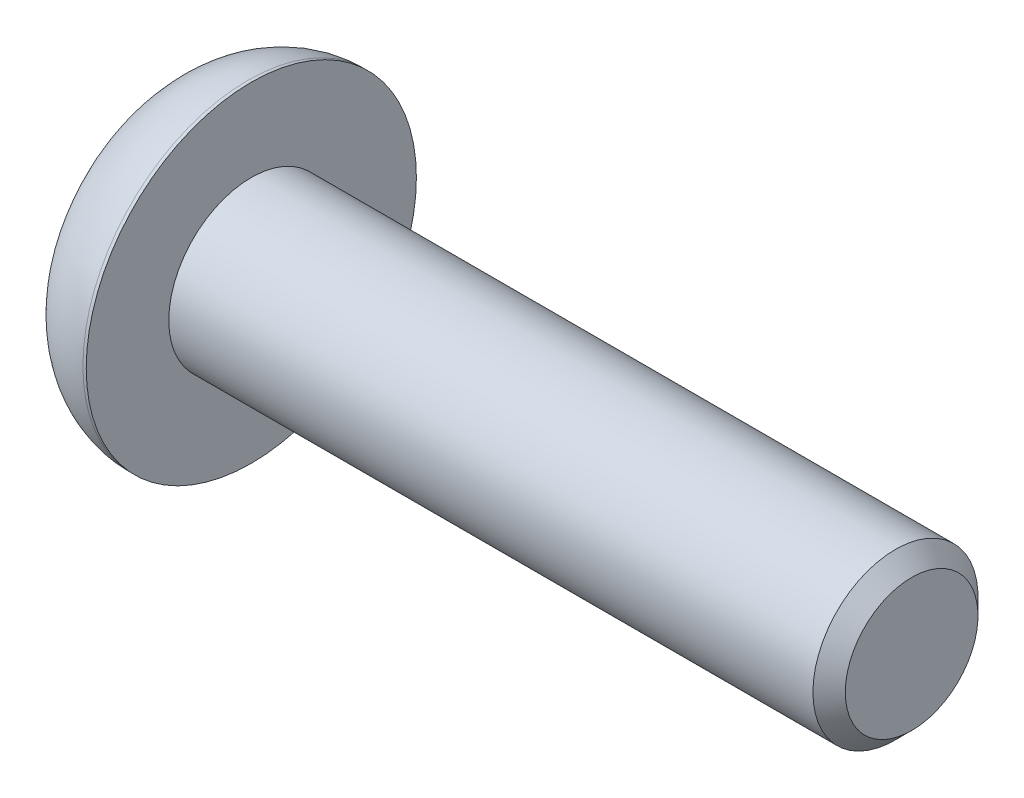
ISO-10303-21;
HEADER;
FILE_DESCRIPTION(('STEP AP214'),'2;1');
FILE_NAME('part.step','',(''),(''),'','','');
FILE_SCHEMA(('AUTOMOTIVE_DESIGN { 1 0 10303 214 1 1 1 1 }'));
ENDSEC;
DATA;
#1=APPLICATION_CONTEXT('core data for automotive mechanical design processes');
#2=APPLICATION_PROTOCOL_DEFINITION('international standard','automotive_design',2000,#1);
#3=PRODUCT_CONTEXT('',#1,'mechanical');
#4=PRODUCT('Part','Part','',(#3));
#5=PRODUCT_RELATED_PRODUCT_CATEGORY('part','',(#4));
#6=PRODUCT_DEFINITION_FORMATION('','',#4);
#7=PRODUCT_DEFINITION_CONTEXT('part definition',#1,'design');
#8=PRODUCT_DEFINITION('design','',#6,#7);
#9=PRODUCT_DEFINITION_SHAPE('','',#8);
#10=(LENGTH_UNIT() NAMED_UNIT(*) SI_UNIT(.MILLI.,.METRE.));
#11=(NAMED_UNIT(*) PLANE_ANGLE_UNIT() SI_UNIT($,.RADIAN.));
#12=(NAMED_UNIT(*) SI_UNIT($,.STERADIAN.) SOLID_ANGLE_UNIT());
#13=UNCERTAINTY_MEASURE_WITH_UNIT(LENGTH_MEASURE(1.E-05),#10,'distance_accuracy_value','');
#14=(GEOMETRIC_REPRESENTATION_CONTEXT(3) GLOBAL_UNCERTAINTY_ASSIGNED_CONTEXT((#13)) GLOBAL_UNIT_ASSIGNED_CONTEXT((#10,
#11,#12)) REPRESENTATION_CONTEXT('',''));
#15=CARTESIAN_POINT('',(0.,0.,0.));
#16=DIRECTION('',(0.,0.,1.));
#17=DIRECTION('',(1.,0.,0.));
#18=AXIS2_PLACEMENT_3D('',#15,#16,#17);
#19=CARTESIAN_POINT('',(1.93397459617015,0.,0.));
#20=DIRECTION('',(-1.,0.,0.));
#21=DIRECTION('',(0.,0.,1.));
#22=AXIS2_PLACEMENT_3D('',#19,#20,#21);
#23=CONICAL_SURFACE('',#22,1.50000000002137,1.04719755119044);
#24=CARTESIAN_POINT('',(2.79999999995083,2.84147705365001E-11,0.));
#25=VERTEX_POINT('',#24);
#26=VERTEX_LOOP('',#25);
#27=FACE_BOUND('',#26,.T.);
#28=CARTESIAN_POINT('',(1.93397459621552,0.,0.));
#29=DIRECTION('',(-1.,0.,0.));
#30=DIRECTION('',(0.,0.,1.));
#31=AXIS2_PLACEMENT_3D('',#28,#29,#30);
#32=CIRCLE('',#31,1.5);
#33=CARTESIAN_POINT('',(1.93397459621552,0.,1.5));
#34=VERTEX_POINT('',#33);
#35=EDGE_CURVE('E133',#34,#34,#32,.T.);
#36=ORIENTED_EDGE('',*,*,#35,.T.);
#37=EDGE_LOOP('',(#36));
#38=FACE_BOUND('',#37,.T.);
#39=ADVANCED_FACE('F16',(#27,#38),#23,.F.);
#40=CARTESIAN_POINT('',(0.966987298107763,0.,0.));
#41=DIRECTION('',(-1.,0.,0.));
#42=DIRECTION('',(0.,0.,1.));
#43=AXIS2_PLACEMENT_3D('',#40,#41,#42);
#44=CYLINDRICAL_SURFACE('',#43,1.5);
#45=ORIENTED_EDGE('',*,*,#35,.F.);
#46=EDGE_LOOP('',(#45));
#47=FACE_BOUND('',#46,.T.);
#48=CARTESIAN_POINT('',(1.82,0.,0.));
#49=DIRECTION('',(-1.,0.,0.));
#50=DIRECTION('',(0.,0.,1.));
#51=AXIS2_PLACEMENT_3D('',#48,#49,#50);
#52=CIRCLE('',#51,1.5);
#53=CARTESIAN_POINT('',(1.82000000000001,1.29903810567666,-0.750000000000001));
#54=VERTEX_POINT('',#53);
#55=CARTESIAN_POINT('',(1.82000000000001,1.29903810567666,0.750000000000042));
#56=VERTEX_POINT('',#55);
#57=EDGE_CURVE('E104',#54,#56,#52,.F.);
#58=ORIENTED_EDGE('',*,*,#57,.F.);
#59=CARTESIAN_POINT('',(1.82,0.,0.));
#60=DIRECTION('',(-1.,0.,0.));
#61=DIRECTION('',(0.,0.,1.));
#62=AXIS2_PLACEMENT_3D('',#59,#60,#61);
#63=CIRCLE('',#62,1.5);
#64=CARTESIAN_POINT('',(1.82000000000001,0.,-1.49999999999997));
#65=VERTEX_POINT('',#64);
#66=EDGE_CURVE('E112',#65,#54,#63,.F.);
#67=ORIENTED_EDGE('',*,*,#66,.F.);
#68=CARTESIAN_POINT('',(1.82,0.,0.));
#69=DIRECTION('',(-1.,0.,0.));
#70=DIRECTION('',(0.,0.,1.));
#71=AXIS2_PLACEMENT_3D('',#68,#69,#70);
#72=CIRCLE('',#71,1.5);
#73=CARTESIAN_POINT('',(1.81999999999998,-1.29903810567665,-0.750000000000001));
#74=VERTEX_POINT('',#73);
#75=EDGE_CURVE('E274',#65,#74,#72,.T.);
#76=ORIENTED_EDGE('',*,*,#75,.T.);
#77=CARTESIAN_POINT('',(1.82,0.,0.));
#78=DIRECTION('',(-1.,0.,0.));
#79=DIRECTION('',(0.,0.,1.));
#80=AXIS2_PLACEMENT_3D('',#77,#78,#79);
#81=CIRCLE('',#80,1.5);
#82=CARTESIAN_POINT('',(1.82000000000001,-1.29903810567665,0.750000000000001));
#83=VERTEX_POINT('',#82);
#84=EDGE_CURVE('E111',#74,#83,#81,.T.);
#85=ORIENTED_EDGE('',*,*,#84,.T.);
#86=CARTESIAN_POINT('',(1.82,0.,0.));
#87=DIRECTION('',(-1.,0.,0.));
#88=DIRECTION('',(0.,0.,1.));
#89=AXIS2_PLACEMENT_3D('',#86,#87,#88);
#90=CIRCLE('',#89,1.5);
#91=CARTESIAN_POINT('',(1.81999999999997,0.,1.50000000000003));
#92=VERTEX_POINT('',#91);
#93=EDGE_CURVE('E131',#92,#83,#90,.F.);
#94=ORIENTED_EDGE('',*,*,#93,.F.);
#95=CARTESIAN_POINT('',(1.82,0.,0.));
#96=DIRECTION('',(-1.,0.,0.));
#97=DIRECTION('',(0.,0.,1.));
#98=AXIS2_PLACEMENT_3D('',#95,#96,#97);
#99=CIRCLE('',#98,1.5);
#100=EDGE_CURVE('E98',#56,#92,#99,.F.);
#101=ORIENTED_EDGE('',*,*,#100,.F.);
#102=EDGE_LOOP('',(#58,#67,#76,#85,#94,#101));
#103=FACE_BOUND('',#102,.T.);
#104=ADVANCED_FACE('F129',(#47,#103),#44,.F.);
#105=CARTESIAN_POINT('',(1.82,0.,0.));
#106=DIRECTION('',(1.,0.,0.));
#107=DIRECTION('',(0.,0.,-1.));
#108=AXIS2_PLACEMENT_3D('',#105,#106,#107);
#109=PLANE('',#108);
#110=DIRECTION('',(0.,0.499999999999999,-0.866025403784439));
#111=VECTOR('',#110,1.);
#112=CARTESIAN_POINT('',(1.81999999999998,-0.866025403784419,-1.49999999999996));
#113=LINE('',#112,#111);
#114=CARTESIAN_POINT('',(1.81999999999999,-1.73205080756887,0.));
#115=VERTEX_POINT('',#114);
#116=EDGE_CURVE('E273',#74,#115,#113,.F.);
#117=ORIENTED_EDGE('',*,*,#116,.T.);
#118=DIRECTION('',(0.,-0.5,-0.866025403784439));
#119=VECTOR('',#118,1.);
#120=CARTESIAN_POINT('',(1.81999999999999,-1.73205080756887,0.));
#121=LINE('',#120,#119);
#122=EDGE_CURVE('E263',#115,#83,#121,.F.);
#123=ORIENTED_EDGE('',*,*,#122,.T.);
#124=ORIENTED_EDGE('',*,*,#84,.F.);
#125=EDGE_LOOP('',(#117,#123,#124));
#126=FACE_BOUND('',#125,.T.);
#127=ADVANCED_FACE('F333',(#126),#109,.F.);
#128=CARTESIAN_POINT('',(1.82,0.,0.));
#129=DIRECTION('',(1.,0.,0.));
#130=DIRECTION('',(0.,0.,-1.));
#131=AXIS2_PLACEMENT_3D('',#128,#129,#130);
#132=PLANE('',#131);
#133=DIRECTION('',(0.,1.,0.));
#134=VECTOR('',#133,1.);
#135=CARTESIAN_POINT('',(1.81999999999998,0.866025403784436,-1.5));
#136=LINE('',#135,#134);
#137=CARTESIAN_POINT('',(1.81999999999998,-0.866025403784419,-1.49999999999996));
#138=VERTEX_POINT('',#137);
#139=EDGE_CURVE('E239',#65,#138,#136,.F.);
#140=ORIENTED_EDGE('',*,*,#139,.T.);
#141=DIRECTION('',(0.,0.499999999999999,-0.866025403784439));
#142=VECTOR('',#141,1.);
#143=CARTESIAN_POINT('',(1.81999999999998,-0.866025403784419,-1.49999999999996));
#144=LINE('',#143,#142);
#145=EDGE_CURVE('E270',#138,#74,#144,.F.);
#146=ORIENTED_EDGE('',*,*,#145,.T.);
#147=ORIENTED_EDGE('',*,*,#75,.F.);
#148=EDGE_LOOP('',(#140,#146,#147));
#149=FACE_BOUND('',#148,.T.);
#150=ADVANCED_FACE('F325',(#149),#132,.F.);
#151=CARTESIAN_POINT('',(0.,-0.866025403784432,-1.49999999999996));
#152=DIRECTION('',(0.,-0.866025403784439,-0.500000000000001));
#153=DIRECTION('',(0.,0.499999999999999,-0.866025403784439));
#154=AXIS2_PLACEMENT_3D('',#151,#152,#153);
#155=PLANE('',#154);
#156=DIRECTION('',(1.,0.,0.));
#157=VECTOR('',#156,1.);
#158=CARTESIAN_POINT('',(0.,-1.73205080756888,0.));
#159=LINE('',#158,#157);
#160=CARTESIAN_POINT('',(0.,-1.73205080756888,0.));
#161=VERTEX_POINT('',#160);
#162=EDGE_CURVE('E283',#161,#115,#159,.T.);
#163=ORIENTED_EDGE('',*,*,#162,.T.);
#164=ORIENTED_EDGE('',*,*,#116,.F.);
#165=ORIENTED_EDGE('',*,*,#145,.F.);
#166=DIRECTION('',(-1.,0.,0.));
#167=VECTOR('',#166,1.);
#168=CARTESIAN_POINT('',(0.,-0.866025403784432,-1.49999999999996));
#169=LINE('',#168,#167);
#170=CARTESIAN_POINT('',(0.,-0.866025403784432,-1.49999999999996));
#171=VERTEX_POINT('',#170);
#172=EDGE_CURVE('E267',#138,#171,#169,.T.);
#173=ORIENTED_EDGE('',*,*,#172,.T.);
#174=DIRECTION('',(0.,0.499999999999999,-0.866025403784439));
#175=VECTOR('',#174,1.);
#176=CARTESIAN_POINT('',(0.,-0.866025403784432,-1.49999999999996));
#177=LINE('',#176,#175);
#178=EDGE_CURVE('E288',#161,#171,#177,.T.);
#179=ORIENTED_EDGE('',*,*,#178,.F.);
#180=EDGE_LOOP('',(#163,#164,#165,#173,#179));
#181=FACE_BOUND('',#180,.T.);
#182=ADVANCED_FACE('F329',(#181),#155,.F.);
#183=CARTESIAN_POINT('',(0.,-1.73205080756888,0.));
#184=DIRECTION('',(0.,-0.866025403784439,0.5));
#185=DIRECTION('',(0.,-0.5,-0.866025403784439));
#186=AXIS2_PLACEMENT_3D('',#183,#184,#185);
#187=PLANE('',#186);
#188=DIRECTION('',(1.,0.,0.));
#189=VECTOR('',#188,1.);
#190=CARTESIAN_POINT('',(0.,-0.866025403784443,1.5));
#191=LINE('',#190,#189);
#192=CARTESIAN_POINT('',(0.,-0.866025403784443,1.5));
#193=VERTEX_POINT('',#192);
#194=CARTESIAN_POINT('',(1.82,-0.866025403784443,1.50000000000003));
#195=VERTEX_POINT('',#194);
#196=EDGE_CURVE('E249',#193,#195,#191,.T.);
#197=ORIENTED_EDGE('',*,*,#196,.T.);
#198=DIRECTION('',(0.,-0.5,-0.866025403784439));
#199=VECTOR('',#198,1.);
#200=CARTESIAN_POINT('',(1.82000000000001,-0.866025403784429,1.50000000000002));
#201=LINE('',#200,#199);
#202=EDGE_CURVE('E240',#195,#83,#201,.T.);
#203=ORIENTED_EDGE('',*,*,#202,.T.);
#204=ORIENTED_EDGE('',*,*,#122,.F.);
#205=ORIENTED_EDGE('',*,*,#162,.F.);
#206=DIRECTION('',(0.,-0.5,-0.866025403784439));
#207=VECTOR('',#206,1.);
#208=CARTESIAN_POINT('',(0.,-1.73205080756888,0.));
#209=LINE('',#208,#207);
#210=EDGE_CURVE('E258',#193,#161,#209,.T.);
#211=ORIENTED_EDGE('',*,*,#210,.F.);
#212=EDGE_LOOP('',(#197,#203,#204,#205,#211));
#213=FACE_BOUND('',#212,.T.);
#214=ADVANCED_FACE('F339',(#213),#187,.F.);
#215=CARTESIAN_POINT('',(1.82,0.,0.));
#216=DIRECTION('',(1.,0.,0.));
#217=DIRECTION('',(0.,0.,-1.));
#218=AXIS2_PLACEMENT_3D('',#215,#216,#217);
#219=PLANE('',#218);
#220=ORIENTED_EDGE('',*,*,#202,.F.);
#221=DIRECTION('',(0.,1.,0.));
#222=VECTOR('',#221,1.);
#223=CARTESIAN_POINT('',(1.82000000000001,-0.866025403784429,1.50000000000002));
#224=LINE('',#223,#222);
#225=EDGE_CURVE('E226',#195,#92,#224,.T.);
#226=ORIENTED_EDGE('',*,*,#225,.T.);
#227=ORIENTED_EDGE('',*,*,#93,.T.);
#228=EDGE_LOOP('',(#220,#226,#227));
#229=FACE_BOUND('',#228,.T.);
#230=ADVANCED_FACE('F336',(#229),#219,.F.);
#231=CARTESIAN_POINT('',(1.82,0.,0.));
#232=DIRECTION('',(1.,0.,0.));
#233=DIRECTION('',(0.,0.,-1.));
#234=AXIS2_PLACEMENT_3D('',#231,#232,#233);
#235=PLANE('',#234);
#236=DIRECTION('',(0.,0.5,0.866025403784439));
#237=VECTOR('',#236,1.);
#238=CARTESIAN_POINT('',(1.82000000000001,1.73205080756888,0.));
#239=LINE('',#238,#237);
#240=CARTESIAN_POINT('',(1.81999999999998,0.866025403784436,-1.5));
#241=VERTEX_POINT('',#240);
#242=EDGE_CURVE('E210',#54,#241,#239,.F.);
#243=ORIENTED_EDGE('',*,*,#242,.T.);
#244=DIRECTION('',(0.,1.,0.));
#245=VECTOR('',#244,1.);
#246=CARTESIAN_POINT('',(1.81999999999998,0.866025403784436,-1.5));
#247=LINE('',#246,#245);
#248=EDGE_CURVE('E236',#241,#65,#247,.F.);
#249=ORIENTED_EDGE('',*,*,#248,.T.);
#250=ORIENTED_EDGE('',*,*,#66,.T.);
#251=EDGE_LOOP('',(#243,#249,#250));
#252=FACE_BOUND('',#251,.T.);
#253=ADVANCED_FACE('F311',(#252),#235,.F.);
#254=CARTESIAN_POINT('',(0.,0.866025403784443,-1.49999999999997));
#255=DIRECTION('',(0.,0.,-1.));
#256=DIRECTION('',(-1.,0.,0.));
#257=AXIS2_PLACEMENT_3D('',#254,#255,#256);
#258=PLANE('',#257);
#259=ORIENTED_EDGE('',*,*,#172,.F.);
#260=ORIENTED_EDGE('',*,*,#139,.F.);
#261=ORIENTED_EDGE('',*,*,#248,.F.);
#262=DIRECTION('',(1.,0.,0.));
#263=VECTOR('',#262,1.);
#264=CARTESIAN_POINT('',(0.,0.866025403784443,-1.49999999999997));
#265=LINE('',#264,#263);
#266=CARTESIAN_POINT('',(0.,0.866025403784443,-1.49999999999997));
#267=VERTEX_POINT('',#266);
#268=EDGE_CURVE('E203',#241,#267,#265,.F.);
#269=ORIENTED_EDGE('',*,*,#268,.T.);
#270=DIRECTION('',(0.,1.,0.));
#271=VECTOR('',#270,1.);
#272=CARTESIAN_POINT('',(0.,0.866025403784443,-1.49999999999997));
#273=LINE('',#272,#271);
#274=EDGE_CURVE('E253',#171,#267,#273,.T.);
#275=ORIENTED_EDGE('',*,*,#274,.F.);
#276=EDGE_LOOP('',(#259,#260,#261,#269,#275));
#277=FACE_BOUND('',#276,.T.);
#278=ADVANCED_FACE('F321',(#277),#258,.F.);
#279=CARTESIAN_POINT('',(0.,-0.866025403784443,1.5));
#280=DIRECTION('',(0.,0.,1.));
#281=DIRECTION('',(1.,0.,0.));
#282=AXIS2_PLACEMENT_3D('',#279,#280,#281);
#283=PLANE('',#282);
#284=DIRECTION('',(1.,0.,0.));
#285=VECTOR('',#284,1.);
#286=CARTESIAN_POINT('',(0.,0.86602540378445,1.5));
#287=LINE('',#286,#285);
#288=CARTESIAN_POINT('',(0.,0.86602540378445,1.5));
#289=VERTEX_POINT('',#288);
#290=CARTESIAN_POINT('',(1.81999999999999,0.866025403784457,1.5));
#291=VERTEX_POINT('',#290);
#292=EDGE_CURVE('E126',#289,#291,#287,.T.);
#293=ORIENTED_EDGE('',*,*,#292,.T.);
#294=DIRECTION('',(0.,1.,0.));
#295=VECTOR('',#294,1.);
#296=CARTESIAN_POINT('',(1.81999999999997,0.,1.50000000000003));
#297=LINE('',#296,#295);
#298=EDGE_CURVE('E125',#291,#92,#297,.F.);
#299=ORIENTED_EDGE('',*,*,#298,.T.);
#300=ORIENTED_EDGE('',*,*,#225,.F.);
#301=ORIENTED_EDGE('',*,*,#196,.F.);
#302=DIRECTION('',(0.,1.,0.));
#303=VECTOR('',#302,1.);
#304=CARTESIAN_POINT('',(0.,-0.866025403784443,1.5));
#305=LINE('',#304,#303);
#306=EDGE_CURVE('E218',#289,#193,#305,.F.);
#307=ORIENTED_EDGE('',*,*,#306,.F.);
#308=EDGE_LOOP('',(#293,#299,#300,#301,#307));
#309=FACE_BOUND('',#308,.T.);
#310=ADVANCED_FACE('F342',(#309),#283,.F.);
#311=CARTESIAN_POINT('',(1.82,0.,0.));
#312=DIRECTION('',(1.,0.,0.));
#313=DIRECTION('',(0.,0.,-1.));
#314=AXIS2_PLACEMENT_3D('',#311,#312,#313);
#315=PLANE('',#314);
#316=ORIENTED_EDGE('',*,*,#298,.F.);
#317=DIRECTION('',(0.,-0.499999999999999,0.866025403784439));
#318=VECTOR('',#317,1.);
#319=CARTESIAN_POINT('',(1.81999999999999,0.866025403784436,1.5));
#320=LINE('',#319,#318);
#321=EDGE_CURVE('E119',#291,#56,#320,.F.);
#322=ORIENTED_EDGE('',*,*,#321,.T.);
#323=ORIENTED_EDGE('',*,*,#100,.T.);
#324=EDGE_LOOP('',(#316,#322,#323));
#325=FACE_BOUND('',#324,.T.);
#326=ADVANCED_FACE('F124',(#325),#315,.F.);
#327=CARTESIAN_POINT('',(1.82,0.,0.));
#328=DIRECTION('',(1.,0.,0.));
#329=DIRECTION('',(0.,0.,-1.));
#330=AXIS2_PLACEMENT_3D('',#327,#328,#329);
#331=PLANE('',#330);
#332=DIRECTION('',(0.,-0.499999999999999,0.866025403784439));
#333=VECTOR('',#332,1.);
#334=CARTESIAN_POINT('',(1.81999999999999,0.866025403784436,1.5));
#335=LINE('',#334,#333);
#336=CARTESIAN_POINT('',(1.82000000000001,1.73205080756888,0.));
#337=VERTEX_POINT('',#336);
#338=EDGE_CURVE('E107',#56,#337,#335,.F.);
#339=ORIENTED_EDGE('',*,*,#338,.T.);
#340=DIRECTION('',(0.,0.5,0.866025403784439));
#341=VECTOR('',#340,1.);
#342=CARTESIAN_POINT('',(1.82000000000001,1.73205080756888,0.));
#343=LINE('',#342,#341);
#344=EDGE_CURVE('E109',#337,#54,#343,.F.);
#345=ORIENTED_EDGE('',*,*,#344,.T.);
#346=ORIENTED_EDGE('',*,*,#57,.T.);
#347=EDGE_LOOP('',(#339,#345,#346));
#348=FACE_BOUND('',#347,.T.);
#349=ADVANCED_FACE('F106',(#348),#331,.F.);
#350=CARTESIAN_POINT('',(0.,1.73205080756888,0.));
#351=DIRECTION('',(0.,0.866025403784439,-0.5));
#352=DIRECTION('',(0.,0.5,0.866025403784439));
#353=AXIS2_PLACEMENT_3D('',#350,#351,#352);
#354=PLANE('',#353);
#355=ORIENTED_EDGE('',*,*,#268,.F.);
#356=ORIENTED_EDGE('',*,*,#242,.F.);
#357=ORIENTED_EDGE('',*,*,#344,.F.);
#358=DIRECTION('',(1.,0.,0.));
#359=VECTOR('',#358,1.);
#360=CARTESIAN_POINT('',(0.,1.73205080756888,0.));
#361=LINE('',#360,#359);
#362=CARTESIAN_POINT('',(0.,1.73205080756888,0.));
#363=VERTEX_POINT('',#362);
#364=EDGE_CURVE('E122',#337,#363,#361,.F.);
#365=ORIENTED_EDGE('',*,*,#364,.T.);
#366=DIRECTION('',(0.,0.5,0.866025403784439));
#367=VECTOR('',#366,1.);
#368=CARTESIAN_POINT('',(0.,1.73205080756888,0.));
#369=LINE('',#368,#367);
#370=EDGE_CURVE('E196',#267,#363,#369,.T.);
#371=ORIENTED_EDGE('',*,*,#370,.F.);
#372=EDGE_LOOP('',(#355,#356,#357,#365,#371));
#373=FACE_BOUND('',#372,.T.);
#374=ADVANCED_FACE('F316',(#373),#354,.F.);
#375=CARTESIAN_POINT('',(0.,0.86602540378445,1.5));
#376=DIRECTION('',(0.,0.866025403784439,0.500000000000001));
#377=DIRECTION('',(0.,-0.499999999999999,0.866025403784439));
#378=AXIS2_PLACEMENT_3D('',#375,#376,#377);
#379=PLANE('',#378);
#380=ORIENTED_EDGE('',*,*,#364,.F.);
#381=ORIENTED_EDGE('',*,*,#338,.F.);
#382=ORIENTED_EDGE('',*,*,#321,.F.);
#383=ORIENTED_EDGE('',*,*,#292,.F.);
#384=DIRECTION('',(0.,-0.499999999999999,0.866025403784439));
#385=VECTOR('',#384,1.);
#386=CARTESIAN_POINT('',(0.,1.73205080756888,0.));
#387=LINE('',#386,#385);
#388=EDGE_CURVE('E214',#363,#289,#387,.T.);
#389=ORIENTED_EDGE('',*,*,#388,.F.);
#390=EDGE_LOOP('',(#380,#381,#382,#383,#389));
#391=FACE_BOUND('',#390,.T.);
#392=ADVANCED_FACE('F117',(#391),#379,.F.);
#393=CARTESIAN_POINT('',(0.,1.15000000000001,0.));
#394=DIRECTION('',(-1.,0.,0.));
#395=DIRECTION('',(0.,0.,1.));
#396=AXIS2_PLACEMENT_3D('',#393,#394,#395);
#397=PLANE('',#396);
#398=CARTESIAN_POINT('',(0.,0.,0.));
#399=DIRECTION('',(1.,0.,0.));
#400=DIRECTION('',(0.,0.,1.));
#401=AXIS2_PLACEMENT_3D('',#398,#399,#400);
#402=CIRCLE('',#401,2.30000000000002);
#403=CARTESIAN_POINT('',(0.,0.,2.30000000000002));
#404=VERTEX_POINT('',#403);
#405=CARTESIAN_POINT('',(0.,0.,-2.29999999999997));
#406=VERTEX_POINT('',#405);
#407=EDGE_CURVE('E174',#404,#406,#402,.T.);
#408=ORIENTED_EDGE('',*,*,#407,.F.);
#409=CARTESIAN_POINT('',(0.,0.,0.));
#410=DIRECTION('',(1.,0.,0.));
#411=DIRECTION('',(0.,1.,0.));
#412=AXIS2_PLACEMENT_3D('',#409,#410,#411);
#413=CIRCLE('',#412,2.30000000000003);
#414=CARTESIAN_POINT('',(0.,2.3,0.));
#415=VERTEX_POINT('',#414);
#416=EDGE_CURVE('E184',#415,#404,#413,.T.);
#417=ORIENTED_EDGE('',*,*,#416,.F.);
#418=CARTESIAN_POINT('',(0.,0.,0.));
#419=DIRECTION('',(1.,0.,0.));
#420=DIRECTION('',(0.,0.,-1.));
#421=AXIS2_PLACEMENT_3D('',#418,#419,#420);
#422=CIRCLE('',#421,2.30000000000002);
#423=EDGE_CURVE('E36',#406,#415,#422,.T.);
#424=ORIENTED_EDGE('',*,*,#423,.F.);
#425=EDGE_LOOP('',(#408,#417,#424));
#426=FACE_BOUND('',#425,.T.);
#427=ORIENTED_EDGE('',*,*,#370,.T.);
#428=ORIENTED_EDGE('',*,*,#388,.T.);
#429=ORIENTED_EDGE('',*,*,#306,.T.);
#430=ORIENTED_EDGE('',*,*,#210,.T.);
#431=ORIENTED_EDGE('',*,*,#178,.T.);
#432=ORIENTED_EDGE('',*,*,#274,.T.);
#433=EDGE_LOOP('',(#427,#428,#429,#430,#431,#432));
#434=FACE_BOUND('',#433,.T.);
#435=ADVANCED_FACE('F153',(#426,#434),#397,.T.);
#436=CARTESIAN_POINT('',(2.7,0.,2.30000000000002));
#437=DIRECTION('',(0.,1.,0.));
#438=DIRECTION('',(0.,0.,1.));
#439=AXIS2_PLACEMENT_3D('',#436,#437,#438);
#440=CIRCLE('',#439,2.7);
#441=TRIMMED_CURVE('',#440,(PARAMETER_VALUE(-2.59030705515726)),
(PARAMETER_VALUE(2.59030705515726)),.T.,.PARAMETER.);
#442=CARTESIAN_POINT('',(2.7,0.,0.));
#443=DIRECTION('',(-1.,0.,0.));
#444=AXIS1_PLACEMENT('',#442,#443);
#445=SURFACE_OF_REVOLUTION('',#441,#444);
#446=ORIENTED_EDGE('',*,*,#416,.T.);
#447=ORIENTED_EDGE('',*,*,#407,.T.);
#448=ORIENTED_EDGE('',*,*,#423,.T.);
#449=EDGE_LOOP('',(#446,#447,#448));
#450=FACE_BOUND('',#449,.T.);
#451=CARTESIAN_POINT('',(2.7,0.,0.));
#452=DIRECTION('',(-1.,0.,0.));
#453=DIRECTION('',(0.,0.,1.));
#454=AXIS2_PLACEMENT_3D('',#451,#452,#453);
#455=CIRCLE('',#454,5.);
#456=CARTESIAN_POINT('',(2.7,0.,5.00000000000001));
#457=VERTEX_POINT('',#456);
#458=EDGE_CURVE('E162',#457,#457,#455,.F.);
#459=ORIENTED_EDGE('',*,*,#458,.F.);
#460=EDGE_LOOP('',(#459));
#461=FACE_BOUND('',#460,.T.);
#462=ADVANCED_FACE('F141',(#450,#461),#445,.F.);
#463=CARTESIAN_POINT('',(22.8,1.00475,0.));
#464=DIRECTION('',(1.,0.,0.));
#465=DIRECTION('',(0.,0.,-1.));
#466=AXIS2_PLACEMENT_3D('',#463,#464,#465);
#467=PLANE('',#466);
#468=CARTESIAN_POINT('',(22.8000000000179,0.,0.));
#469=DIRECTION('',(-1.,0.,0.));
#470=DIRECTION('',(0.,0.,1.));
#471=AXIS2_PLACEMENT_3D('',#468,#469,#470);
#472=CIRCLE('',#471,2.00949999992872);
#473=CARTESIAN_POINT('',(22.8000000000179,0.,2.00949999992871));
#474=VERTEX_POINT('',#473);
#475=EDGE_CURVE('E305',#474,#474,#472,.T.);
#476=ORIENTED_EDGE('',*,*,#475,.F.);
#477=EDGE_LOOP('',(#476));
#478=FACE_BOUND('',#477,.T.);
#479=ADVANCED_FACE('F152',(#478),#467,.T.);
#480=CARTESIAN_POINT('',(2.74999999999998,0.,0.));
#481=DIRECTION('',(-1.,0.,0.));
#482=DIRECTION('',(0.,0.,1.));
#483=AXIS2_PLACEMENT_3D('',#480,#481,#482);
#484=CYLINDRICAL_SURFACE('',#483,5.);
#485=ORIENTED_EDGE('',*,*,#458,.T.);
#486=EDGE_LOOP('',(#485));
#487=FACE_BOUND('',#486,.T.);
#488=CARTESIAN_POINT('',(2.8,0.,0.));
#489=DIRECTION('',(-1.,0.,0.));
#490=DIRECTION('',(0.,0.,1.));
#491=AXIS2_PLACEMENT_3D('',#488,#489,#490);
#492=CIRCLE('',#491,5.);
#493=CARTESIAN_POINT('',(2.8,0.,5.00000000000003));
#494=VERTEX_POINT('',#493);
#495=EDGE_CURVE('E302',#494,#494,#492,.F.);
#496=ORIENTED_EDGE('',*,*,#495,.F.);
#497=EDGE_LOOP('',(#496));
#498=FACE_BOUND('',#497,.T.);
#499=ADVANCED_FACE('F365',(#487,#498),#484,.T.);
#500=CARTESIAN_POINT('',(22.3095000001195,0.,0.));
#501=DIRECTION('',(-1.,0.,0.));
#502=DIRECTION('',(0.,0.,1.));
#503=AXIS2_PLACEMENT_3D('',#500,#501,#502);
#504=CONICAL_SURFACE('',#503,2.4999999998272,0.785398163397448);
#505=ORIENTED_EDGE('',*,*,#475,.T.);
#506=EDGE_LOOP('',(#505));
#507=FACE_BOUND('',#506,.T.);
#508=CARTESIAN_POINT('',(22.3095,0.,0.));
#509=DIRECTION('',(-1.,0.,0.));
#510=DIRECTION('',(0.,0.,1.));
#511=AXIS2_PLACEMENT_3D('',#508,#509,#510);
#512=CIRCLE('',#511,2.5);
#513=CARTESIAN_POINT('',(22.3095,0.,2.50000000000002));
#514=VERTEX_POINT('',#513);
#515=EDGE_CURVE('E27',#514,#514,#512,.T.);
#516=ORIENTED_EDGE('',*,*,#515,.F.);
#517=EDGE_LOOP('',(#516));
#518=FACE_BOUND('',#517,.T.);
#519=ADVANCED_FACE('F358',(#507,#518),#504,.T.);
#520=CARTESIAN_POINT('',(2.80000000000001,3.75,0.));
#521=DIRECTION('',(1.,0.,0.));
#522=DIRECTION('',(0.,0.,-1.));
#523=AXIS2_PLACEMENT_3D('',#520,#521,#522);
#524=PLANE('',#523);
#525=CARTESIAN_POINT('',(2.8,0.,0.));
#526=DIRECTION('',(-1.,0.,0.));
#527=DIRECTION('',(0.,0.,1.));
#528=AXIS2_PLACEMENT_3D('',#525,#526,#527);
#529=CIRCLE('',#528,2.5);
#530=CARTESIAN_POINT('',(2.8,0.,2.50000000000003));
#531=VERTEX_POINT('',#530);
#532=EDGE_CURVE('E11',#531,#531,#529,.F.);
#533=ORIENTED_EDGE('',*,*,#532,.F.);
#534=EDGE_LOOP('',(#533));
#535=FACE_BOUND('',#534,.T.);
#536=ORIENTED_EDGE('',*,*,#495,.T.);
#537=EDGE_LOOP('',(#536));
#538=FACE_BOUND('',#537,.T.);
#539=ADVANCED_FACE('F352',(#535,#538),#524,.T.);
#540=CARTESIAN_POINT('',(12.55475,0.,0.));
#541=DIRECTION('',(-1.,0.,0.));
#542=DIRECTION('',(0.,0.,1.));
#543=AXIS2_PLACEMENT_3D('',#540,#541,#542);
#544=CYLINDRICAL_SURFACE('',#543,2.5);
#545=ORIENTED_EDGE('',*,*,#515,.T.);
#546=EDGE_LOOP('',(#545));
#547=FACE_BOUND('',#546,.T.);
#548=ORIENTED_EDGE('',*,*,#532,.T.);
#549=EDGE_LOOP('',(#548));
#550=FACE_BOUND('',#549,.T.);
#551=ADVANCED_FACE('F350',(#547,#550),#544,.T.);
#552=CLOSED_SHELL('',(#39,#104,#127,#150,#182,#214,#230,#253,#278,#310,#326,#349,#374,#392,#435,
#462,#479,#499,#519,#539,#551));
#553=MANIFOLD_SOLID_BREP('B1',#552);
#554=ADVANCED_BREP_SHAPE_REPRESENTATION('',(#18,#553),#14);
#555=SHAPE_DEFINITION_REPRESENTATION(#9,#554);
ENDSEC;
END-ISO-10303-21;
